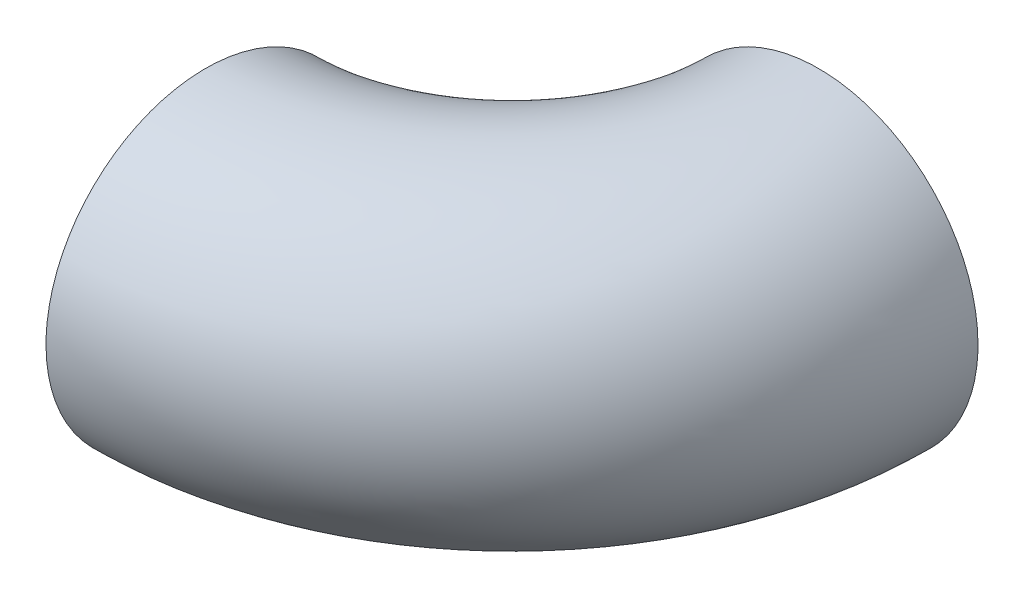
ISO-10303-21;
HEADER;
FILE_DESCRIPTION(('STEP AP214'),'2;1');
FILE_NAME('part.step','',(''),(''),'','','');
FILE_SCHEMA(('AUTOMOTIVE_DESIGN { 1 0 10303 214 1 1 1 1 }'));
ENDSEC;
DATA;
#1=APPLICATION_CONTEXT('core data for automotive mechanical design processes');
#2=APPLICATION_PROTOCOL_DEFINITION('international standard','automotive_design',2000,#1);
#3=PRODUCT_CONTEXT('',#1,'mechanical');
#4=PRODUCT('Part','Part','',(#3));
#5=PRODUCT_RELATED_PRODUCT_CATEGORY('part','',(#4));
#6=PRODUCT_DEFINITION_FORMATION('','',#4);
#7=PRODUCT_DEFINITION_CONTEXT('part definition',#1,'design');
#8=PRODUCT_DEFINITION('design','',#6,#7);
#9=PRODUCT_DEFINITION_SHAPE('','',#8);
#10=(LENGTH_UNIT() NAMED_UNIT(*) SI_UNIT(.MILLI.,.METRE.));
#11=(NAMED_UNIT(*) PLANE_ANGLE_UNIT() SI_UNIT($,.RADIAN.));
#12=(NAMED_UNIT(*) SI_UNIT($,.STERADIAN.) SOLID_ANGLE_UNIT());
#13=UNCERTAINTY_MEASURE_WITH_UNIT(LENGTH_MEASURE(1.E-05),#10,'distance_accuracy_value','');
#14=(GEOMETRIC_REPRESENTATION_CONTEXT(3) GLOBAL_UNCERTAINTY_ASSIGNED_CONTEXT((#13)) GLOBAL_UNIT_ASSIGNED_CONTEXT((#10,
#11,#12)) REPRESENTATION_CONTEXT('',''));
#15=CARTESIAN_POINT('',(0.,0.,0.));
#16=DIRECTION('',(0.,0.,1.));
#17=DIRECTION('',(1.,0.,0.));
#18=AXIS2_PLACEMENT_3D('',#15,#16,#17);
#19=CARTESIAN_POINT('',(7.12,0.,1.759999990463));
#20=DIRECTION('',(1.,0.,0.));
#21=DIRECTION('',(0.,0.,-1.));
#22=AXIS2_PLACEMENT_3D('',#19,#20,#21);
#23=PLANE('',#22);
#24=CARTESIAN_POINT('',(7.12,0.,1.759999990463));
#25=CARTESIAN_POINT('',(7.12,-0.0146159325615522,1.7600015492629));
#26=CARTESIAN_POINT('',(7.12,-0.0292223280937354,1.75876596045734));
#27=CARTESIAN_POINT('',(7.12,-0.0580434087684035,1.75385931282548));
#28=CARTESIAN_POINT('',(7.12,-0.0722576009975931,1.75018532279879));
#29=CARTESIAN_POINT('',(7.12,-0.0998474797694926,1.74050788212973));
#30=CARTESIAN_POINT('',(7.12,-0.11322422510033,1.73450744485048));
#31=CARTESIAN_POINT('',(7.12,-0.138799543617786,1.72033758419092));
#32=CARTESIAN_POINT('',(7.12,-0.150996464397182,1.71216517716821));
#33=CARTESIAN_POINT('',(7.12,-0.173827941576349,1.69390019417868));
#34=CARTESIAN_POINT('',(7.12,-0.18446464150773,1.68381029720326));
#35=CARTESIAN_POINT('',(7.12,-0.203908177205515,1.66197364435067));
#36=CARTESIAN_POINT('',(7.12,-0.212712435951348,1.65022459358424));
#37=CARTESIAN_POINT('',(7.12,-0.228211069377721,1.62543179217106));
#38=CARTESIAN_POINT('',(7.12,-0.234908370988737,1.61238987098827));
#39=CARTESIAN_POINT('',(7.12,-0.246027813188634,1.58534825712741));
#40=CARTESIAN_POINT('',(7.12,-0.250446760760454,1.57134725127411));
#41=CARTESIAN_POINT('',(7.12,-0.256865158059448,1.54282191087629));
#42=CARTESIAN_POINT('',(7.12,-0.258867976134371,1.52829833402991));
#43=CARTESIAN_POINT('',(7.12,-0.260409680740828,1.49910049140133));
#44=CARTESIAN_POINT('',(7.12,-0.259945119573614,1.48442604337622));
#45=CARTESIAN_POINT('',(7.12,-0.256559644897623,1.45538418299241));
#46=CARTESIAN_POINT('',(7.12,-0.253642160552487,1.44101637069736));
#47=CARTESIAN_POINT('',(7.12,-0.245432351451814,1.41295413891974));
#48=CARTESIAN_POINT('',(7.12,-0.240136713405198,1.39926068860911));
#49=CARTESIAN_POINT('',(7.12,-0.227328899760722,1.37297653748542));
#50=CARTESIAN_POINT('',(7.12,-0.219819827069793,1.36038432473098));
#51=CARTESIAN_POINT('',(7.12,-0.202784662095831,1.33662157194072));
#52=CARTESIAN_POINT('',(7.12,-0.193255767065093,1.32545304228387));
#53=CARTESIAN_POINT('',(7.12,-0.172467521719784,1.30488974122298));
#54=CARTESIAN_POINT('',(7.12,-0.161210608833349,1.2954925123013));
#55=CARTESIAN_POINT('',(7.12,-0.13727855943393,1.27870917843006));
#56=CARTESIAN_POINT('',(7.12,-0.124601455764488,1.27132591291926));
#57=CARTESIAN_POINT('',(7.12,-0.0850045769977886,1.25257487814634));
#58=CARTESIAN_POINT('',(7.12,-0.0564256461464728,1.2445147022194));
#59=CARTESIAN_POINT('',(7.12,0.00178562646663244,1.23836398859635));
#60=CARTESIAN_POINT('',(7.12,0.0314179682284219,1.24027345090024));
#61=CARTESIAN_POINT('',(7.12,0.0740592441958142,1.25033504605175));
#62=CARTESIAN_POINT('',(7.12,0.0879994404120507,1.25490587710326));
#63=CARTESIAN_POINT('',(7.12,0.114910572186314,1.26631702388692));
#64=CARTESIAN_POINT('',(7.12,0.127882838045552,1.27315415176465));
#65=CARTESIAN_POINT('',(7.12,0.152509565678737,1.28891882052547));
#66=CARTESIAN_POINT('',(7.12,0.164162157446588,1.29784927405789));
#67=CARTESIAN_POINT('',(7.12,0.185787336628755,1.3175271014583));
#68=CARTESIAN_POINT('',(7.12,0.195762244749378,1.32827192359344));
#69=CARTESIAN_POINT('',(7.12,0.213780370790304,1.35129894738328));
#70=CARTESIAN_POINT('',(7.12,0.221820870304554,1.36358327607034));
#71=CARTESIAN_POINT('',(7.12,0.235714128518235,1.3893100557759));
#72=CARTESIAN_POINT('',(7.12,0.241569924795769,1.40275086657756));
#73=CARTESIAN_POINT('',(7.12,0.250950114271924,1.43044388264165));
#74=CARTESIAN_POINT('',(7.12,0.254471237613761,1.44469719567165));
#75=CARTESIAN_POINT('',(7.12,0.259065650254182,1.47357248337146));
#76=CARTESIAN_POINT('',(7.12,0.260142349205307,1.4881939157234));
#77=CARTESIAN_POINT('',(7.12,0.259827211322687,1.51743073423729));
#78=CARTESIAN_POINT('',(7.12,0.25843192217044,1.53204608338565));
#79=CARTESIAN_POINT('',(7.12,0.253209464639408,1.56081441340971));
#80=CARTESIAN_POINT('',(7.12,0.249385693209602,1.57496801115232));
#81=CARTESIAN_POINT('',(7.12,0.239410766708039,1.60245239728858));
#82=CARTESIAN_POINT('',(7.12,0.233256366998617,1.61578200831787));
#83=CARTESIAN_POINT('',(7.12,0.218805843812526,1.641199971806));
#84=CARTESIAN_POINT('',(7.12,0.210512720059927,1.65329002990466));
#85=CARTESIAN_POINT('',(7.12,0.192002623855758,1.67592324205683));
#86=CARTESIAN_POINT('',(7.12,0.181782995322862,1.6864642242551));
#87=CARTESIAN_POINT('',(7.12,0.159733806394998,1.70566618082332));
#88=CARTESIAN_POINT('',(7.12,0.147906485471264,1.71432972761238));
#89=CARTESIAN_POINT('',(7.12,0.122948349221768,1.7295594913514));
#90=CARTESIAN_POINT('',(7.12,0.109815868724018,1.73612298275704));
#91=CARTESIAN_POINT('',(7.12,0.0826566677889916,1.74694461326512));
#92=CARTESIAN_POINT('',(7.12,0.0686310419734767,1.75120551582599));
#93=CARTESIAN_POINT('',(7.12,0.0364982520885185,1.75806902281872));
#94=CARTESIAN_POINT('',(7.12,0.0182416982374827,1.75999804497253));
#95=CARTESIAN_POINT('',(7.12,0.,1.759999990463));
#96=B_SPLINE_CURVE_WITH_KNOTS('',3,(#24,#25,#26,#27,#28,#29,#30,#31,#32,#33,#34,#35,#36,#37,#38,
#39,#40,#41,#42,#43,#44,#45,#46,#47,#48,#49,#50,#51,#52,#53,#54,#55,#56,#57,#58,#59,#60,#61,#62,
#63,#64,#65,#66,#67,#68,#69,#70,#71,#72,#73,#74,#75,#76,#77,#78,#79,#80,#81,#82,#83,#84,#85,#86,
#87,#88,#89,#90,#91,#92,#93,#94,#95),.UNSPECIFIED.,.T.,.F.,(4,2,2,2,2,2,2,2,2,2,2,2,2,2,2,2,2,2,
2,2,2,2,2,2,2,2,2,2,2,2,2,2,2,2,2,4),(0.,0.043779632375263,0.0876119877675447,0.131387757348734,
0.175223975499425,0.218999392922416,0.262835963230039,0.306611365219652,0.3504479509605,
0.394223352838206,0.438059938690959,0.481835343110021,0.525671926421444,0.569447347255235,
0.613283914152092,0.657059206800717,0.700895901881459,0.788196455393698,0.875497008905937,
0.919333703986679,0.963108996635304,1.00694556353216,1.05072098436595,1.09455756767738,
1.13833297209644,1.18216955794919,1.2259449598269,1.26978154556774,1.31355694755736,
1.35739351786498,1.40116893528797,1.44500515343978,1.48878092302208,1.53261327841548,
1.57639291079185,1.63103293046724),.UNSPECIFIED.);
#97=CARTESIAN_POINT('',(7.12,0.,1.759999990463));
#98=VERTEX_POINT('',#97);
#99=EDGE_CURVE('E19',#98,#98,#96,.T.);
#100=ORIENTED_EDGE('',*,*,#99,.F.);
#101=EDGE_LOOP('',(#100));
#102=FACE_BOUND('',#101,.T.);
#103=ADVANCED_FACE('F15',(#102),#23,.F.);
#104=CARTESIAN_POINT('',(7.879999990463,0.,1.));
#105=DIRECTION('',(0.,0.,-1.));
#106=DIRECTION('',(0.,1.,0.));
#107=AXIS2_PLACEMENT_3D('',#104,#105,#106);
#108=PLANE('',#107);
#109=CARTESIAN_POINT('',(7.879999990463,0.,1.));
#110=CARTESIAN_POINT('',(7.8800015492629,0.0146159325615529,1.));
#111=CARTESIAN_POINT('',(7.87876596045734,0.029222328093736,1.));
#112=CARTESIAN_POINT('',(7.87385931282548,0.058043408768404,1.));
#113=CARTESIAN_POINT('',(7.87018532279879,0.0722576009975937,1.));
#114=CARTESIAN_POINT('',(7.86050788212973,0.099847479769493,1.));
#115=CARTESIAN_POINT('',(7.85450744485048,0.11322422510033,1.));
#116=CARTESIAN_POINT('',(7.84033758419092,0.138799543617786,1.));
#117=CARTESIAN_POINT('',(7.83216517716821,0.150996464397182,1.));
#118=CARTESIAN_POINT('',(7.81390019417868,0.173827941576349,1.));
#119=CARTESIAN_POINT('',(7.80381029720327,0.18446464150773,1.));
#120=CARTESIAN_POINT('',(7.78197364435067,0.203908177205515,1.));
#121=CARTESIAN_POINT('',(7.77022459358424,0.212712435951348,1.));
#122=CARTESIAN_POINT('',(7.74543179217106,0.228211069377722,1.));
#123=CARTESIAN_POINT('',(7.73238987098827,0.234908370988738,1.));
#124=CARTESIAN_POINT('',(7.70534825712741,0.246027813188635,1.));
#125=CARTESIAN_POINT('',(7.69134725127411,0.250446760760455,1.));
#126=CARTESIAN_POINT('',(7.66282191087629,0.256865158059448,1.));
#127=CARTESIAN_POINT('',(7.64829833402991,0.258867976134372,1.));
#128=CARTESIAN_POINT('',(7.61910049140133,0.260409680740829,1.));
#129=CARTESIAN_POINT('',(7.60442604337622,0.259945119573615,1.));
#130=CARTESIAN_POINT('',(7.57538418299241,0.256559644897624,1.));
#131=CARTESIAN_POINT('',(7.56101637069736,0.253642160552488,1.));
#132=CARTESIAN_POINT('',(7.53295413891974,0.245432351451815,1.));
#133=CARTESIAN_POINT('',(7.51926068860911,0.240136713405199,1.));
#134=CARTESIAN_POINT('',(7.49297653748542,0.227328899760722,1.));
#135=CARTESIAN_POINT('',(7.48038432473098,0.219819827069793,1.));
#136=CARTESIAN_POINT('',(7.45662157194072,0.202784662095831,1.));
#137=CARTESIAN_POINT('',(7.44545304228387,0.193255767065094,1.));
#138=CARTESIAN_POINT('',(7.42488974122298,0.172467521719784,1.));
#139=CARTESIAN_POINT('',(7.4154925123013,0.161210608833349,1.));
#140=CARTESIAN_POINT('',(7.39870917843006,0.13727855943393,1.));
#141=CARTESIAN_POINT('',(7.39132591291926,0.124601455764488,1.));
#142=CARTESIAN_POINT('',(7.37257487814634,0.0850045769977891,1.));
#143=CARTESIAN_POINT('',(7.3645147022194,0.0564256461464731,1.));
#144=CARTESIAN_POINT('',(7.35836398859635,-0.00178562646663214,1.));
#145=CARTESIAN_POINT('',(7.36027345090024,-0.0314179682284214,1.));
#146=CARTESIAN_POINT('',(7.37033504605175,-0.0740592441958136,1.));
#147=CARTESIAN_POINT('',(7.37490587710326,-0.0879994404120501,1.));
#148=CARTESIAN_POINT('',(7.38631702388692,-0.114910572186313,1.));
#149=CARTESIAN_POINT('',(7.39315415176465,-0.127882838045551,1.));
#150=CARTESIAN_POINT('',(7.40891882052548,-0.152509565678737,1.));
#151=CARTESIAN_POINT('',(7.41784927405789,-0.164162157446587,1.));
#152=CARTESIAN_POINT('',(7.4375271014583,-0.185787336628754,1.));
#153=CARTESIAN_POINT('',(7.44827192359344,-0.195762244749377,1.));
#154=CARTESIAN_POINT('',(7.47129894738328,-0.213780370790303,1.));
#155=CARTESIAN_POINT('',(7.48358327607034,-0.221820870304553,1.));
#156=CARTESIAN_POINT('',(7.5093100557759,-0.235714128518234,1.));
#157=CARTESIAN_POINT('',(7.52275086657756,-0.241569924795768,1.));
#158=CARTESIAN_POINT('',(7.55044388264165,-0.250950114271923,1.));
#159=CARTESIAN_POINT('',(7.56469719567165,-0.254471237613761,1.));
#160=CARTESIAN_POINT('',(7.59357248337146,-0.259065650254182,1.));
#161=CARTESIAN_POINT('',(7.60819391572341,-0.260142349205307,1.));
#162=CARTESIAN_POINT('',(7.63743073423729,-0.259827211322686,1.));
#163=CARTESIAN_POINT('',(7.65204608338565,-0.258431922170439,1.));
#164=CARTESIAN_POINT('',(7.68081441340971,-0.253209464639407,1.));
#165=CARTESIAN_POINT('',(7.69496801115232,-0.249385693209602,1.));
#166=CARTESIAN_POINT('',(7.72245239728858,-0.239410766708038,1.));
#167=CARTESIAN_POINT('',(7.73578200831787,-0.233256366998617,1.));
#168=CARTESIAN_POINT('',(7.761199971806,-0.218805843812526,1.));
#169=CARTESIAN_POINT('',(7.77329002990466,-0.210512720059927,1.));
#170=CARTESIAN_POINT('',(7.79592324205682,-0.192002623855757,1.));
#171=CARTESIAN_POINT('',(7.8064642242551,-0.181782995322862,1.));
#172=CARTESIAN_POINT('',(7.82566618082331,-0.159733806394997,1.));
#173=CARTESIAN_POINT('',(7.83432972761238,-0.147906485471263,1.));
#174=CARTESIAN_POINT('',(7.8495594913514,-0.122948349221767,1.));
#175=CARTESIAN_POINT('',(7.85612298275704,-0.109815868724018,1.));
#176=CARTESIAN_POINT('',(7.86694461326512,-0.0826566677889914,1.));
#177=CARTESIAN_POINT('',(7.87120551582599,-0.0686310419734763,1.));
#178=CARTESIAN_POINT('',(7.87806902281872,-0.0364982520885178,1.));
#179=CARTESIAN_POINT('',(7.87999804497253,-0.0182416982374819,1.));
#180=CARTESIAN_POINT('',(7.879999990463,0.,1.));
#181=B_SPLINE_CURVE_WITH_KNOTS('',3,(#109,#110,#111,#112,#113,#114,#115,#116,#117,#118,#119,
#120,#121,#122,#123,#124,#125,#126,#127,#128,#129,#130,#131,#132,#133,#134,#135,#136,#137,#138,
#139,#140,#141,#142,#143,#144,#145,#146,#147,#148,#149,#150,#151,#152,#153,#154,#155,#156,#157,
#158,#159,#160,#161,#162,#163,#164,#165,#166,#167,#168,#169,#170,#171,#172,#173,#174,#175,#176,
#177,#178,#179,#180),.UNSPECIFIED.,.T.,.F.,(4,2,2,2,2,2,2,2,2,2,2,2,2,2,2,2,2,2,2,2,2,2,2,2,2,2,
2,2,2,2,2,2,2,2,2,4),(0.,0.0437796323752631,0.0876119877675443,0.131387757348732,
0.175223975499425,0.218999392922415,0.262835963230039,0.306611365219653,0.350447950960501,
0.394223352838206,0.438059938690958,0.48183534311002,0.525671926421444,0.569447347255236,
0.613283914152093,0.657059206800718,0.700895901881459,0.788196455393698,0.875497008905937,
0.919333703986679,0.963108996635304,1.00694556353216,1.05072098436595,1.09455756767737,
1.13833297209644,1.18216955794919,1.2259449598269,1.26978154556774,1.31355694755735,
1.35739351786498,1.40116893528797,1.44500515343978,1.48878092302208,1.53261327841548,
1.57639291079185,1.63103293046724),.UNSPECIFIED.);
#182=CARTESIAN_POINT('',(7.879999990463,0.,1.));
#183=VERTEX_POINT('',#182);
#184=EDGE_CURVE('E10',#183,#183,#181,.T.);
#185=ORIENTED_EDGE('',*,*,#184,.F.);
#186=EDGE_LOOP('',(#185));
#187=FACE_BOUND('',#186,.T.);
#188=ADVANCED_FACE('F35',(#187),#108,.T.);
#189=CARTESIAN_POINT('',(7.12,0.,1.));
#190=DIRECTION('',(0.,-1.,0.));
#191=DIRECTION('',(1.,0.,0.));
#192=AXIS2_PLACEMENT_3D('',#189,#190,#191);
#193=TOROIDAL_SURFACE('',#192,0.5,0.259999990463);
#194=ORIENTED_EDGE('',*,*,#99,.T.);
#195=EDGE_LOOP('',(#194));
#196=FACE_BOUND('',#195,.T.);
#197=ORIENTED_EDGE('',*,*,#184,.T.);
#198=EDGE_LOOP('',(#197));
#199=FACE_BOUND('',#198,.T.);
#200=ADVANCED_FACE('F33',(#196,#199),#193,.T.);
#201=CLOSED_SHELL('',(#103,#188,#200));
#202=MANIFOLD_SOLID_BREP('B1',#201);
#203=ADVANCED_BREP_SHAPE_REPRESENTATION('',(#18,#202),#14);
#204=SHAPE_DEFINITION_REPRESENTATION(#9,#203);
ENDSEC;
END-ISO-10303-21;
